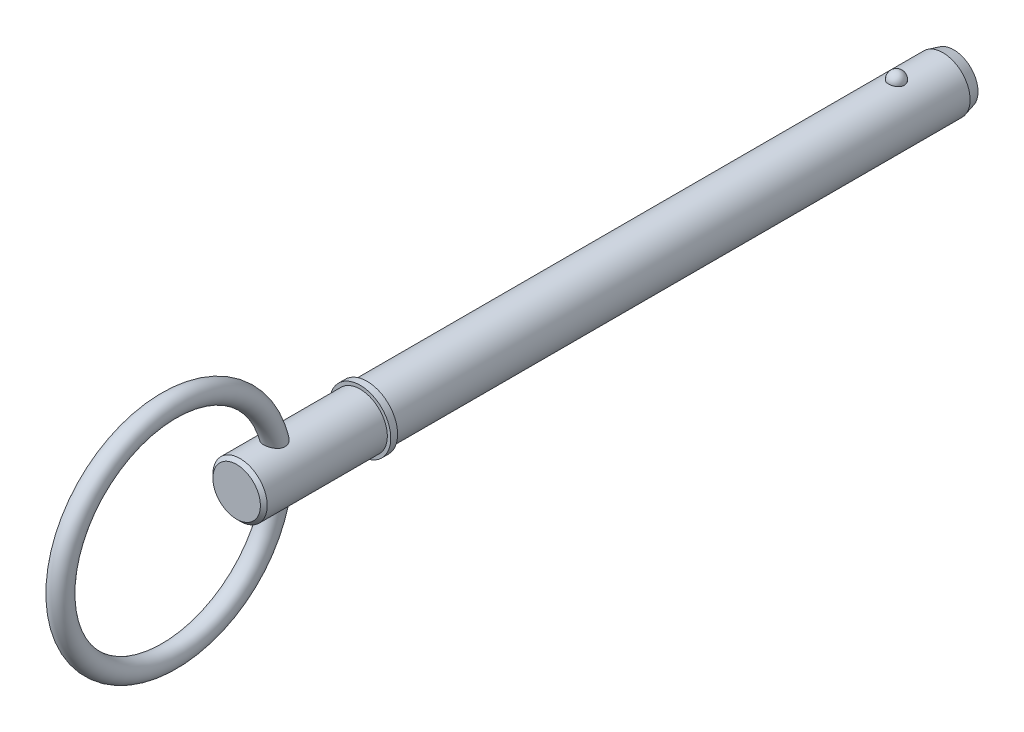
from build123d import *

# Parameters (mm, degrees)
SKETCH2_R           = 3.97
BOSS_EXTRUDE1_DEPTH = 76.2
BOSS_EXTRUDE2_START = 9.53
SKETCH3_R           = 3.97
BOSS_EXTRUDE2_DEPTH = 9.53
CHAMFER1_SIZE       = 1.586
CHAMFER1_SIZE2      = 0.424967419
SKETCH20_W          = 1
SKETCH20_H          = 4.47
SKETCH21_R          = 3.97
BOSS_EXTRUDE3_DEPTH = 19.05
CHAMFER2_SIZE       = 0.5
SKETCH24_R          = 1.5


with BuildPart() as part:
    # Sketch2 → Boss-Extrude1 (new body)
    with BuildSketch(Plane.XY):
        with Locations(Location((0, 0, 0), (0, 0, 180))):
            Circle(SKETCH2_R)
    extrude(amount=BOSS_EXTRUDE1_DEPTH)

    # Sketch3 → Boss-Extrude2 (add)
    with BuildSketch(Plane(origin=(0, 0, 0), x_dir=(-1, 0, 0), z_dir=(0, 0, -1)).offset(BOSS_EXTRUDE2_START)):
        Circle(SKETCH3_R)
    extrude(amount=-BOSS_EXTRUDE2_DEPTH)

    # Chamfer1
    chamfer1_edges = [part.edges().sort_by_distance(p)[0] for p in [
        (3.97, 0, -9.53),
    ]]
    chamfer1_side = [part.faces().sort_by_distance(p)[0] for p in [
        (3.97, 0, 33.335),
    ]]
    chamfer(chamfer1_edges, length=CHAMFER1_SIZE, length2=CHAMFER1_SIZE2, reference=chamfer1_side[0])

    # Sketch18 → Revolve1 (revolve)
    with BuildSketch(Plane(origin=(0, 0, 0), x_dir=(0, 0, -1), z_dir=(1, 0, 0))):
        with BuildLine():
            Line((1.15, 5.12), (1.15, 2.82))
            ThreePointArc((1.15, 2.82), (0, 3.97), (1.15, 5.12))
        make_face()
    revolve(axis=Axis((0, 5.12, -1.15), (0, -1, 0)))

    # Sketch20 → Revolve2 (revolve)
    with BuildSketch(Plane(origin=(0, 0, 0), x_dir=(0, 0, -1), z_dir=(1, 0, 0)), mode=Mode.PRIVATE) as revolve2_sk:
        with Locations((-76.7, 2.235)):
            Rectangle(SKETCH20_W, SKETCH20_H)
    revolve(revolve2_sk.sketch.rotate(Axis((0, 0, 33.728787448), (0, 0, 1)), 90), axis=Axis((0, 0, 33.728787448), (0, 0, 1)))

    # Sketch21 → Boss-Extrude3 (add)
    with BuildSketch(Plane(origin=(0, 0, 76.2), x_dir=(-1, 0, 0), z_dir=(0, 0, -1))):
        Circle(SKETCH21_R)
    extrude(amount=-BOSS_EXTRUDE3_DEPTH)

    # Chamfer2
    chamfer2_edges = [part.edges().sort_by_distance(p)[0] for p in [
        (3.97, 0, 95.25),
    ]]
    chamfer(chamfer2_edges, length=CHAMFER2_SIZE)

    # Sweep1: sweep along a path in Sketch23
    with BuildLine(Plane(origin=(0, 0, 0), x_dir=(0, 0, -1), z_dir=(1, 0, 0))) as sweep1_path:
        CenterArc((-105.125, 0), 15.875, 0, 360)
    # Sketch24 → Sweep1 (sweep)
    with BuildSketch(Plane(origin=(0, 0, 0), x_dir=(1, 0, 0), z_dir=(0, 1, 0))):
        with Locations((0, -89.25)):
            Circle(SKETCH24_R)
    sweep(path=sweep1_path.line)


solid = part.part
